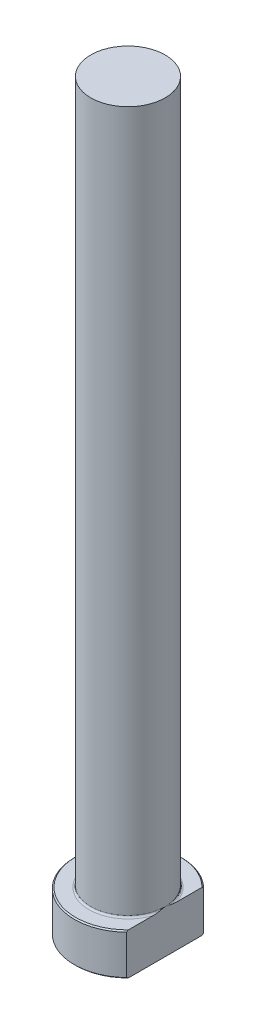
from build123d import *
from build123d.topology import SkipClean

# Parameters (mm, degrees)
CHAMFER1_SIZE = 0.2
FILLET1_R     = 0.3
KEY_DEPTH     = 126.646329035


with BuildPart() as part:
    # Sketch1 → Revolve1 (revolve)
    with BuildSketch(Plane.XY, mode=Mode.PRIVATE) as revolve1_sk:
        Polygon((0, 0), (-9, 0), (-9, 7), (-6.25, 7), (-6.25, 125), (0, 125), align=None)
    revolve(revolve1_sk.sketch.rotate(Axis((0, 259.958771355, 0), (0, -1, 0)), 270), axis=Axis((0, 259.958771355, 0), (0, -1, 0)))

    # Chamfer1
    chamfer1_edges = [part.edges().sort_by_distance(p)[0] for p in [
        (0, 7, -9),
        (0, 0, -9),
    ]]
    chamfer(chamfer1_edges, length=CHAMFER1_SIZE)

    # Fillet1
    fillet1_edges = [part.edges().sort_by_distance(p)[0] for p in [
        (0, 7, -6.25),
    ]]
    fillet(fillet1_edges, radius=FILLET1_R)

    # Sketch2 → KEY (cut, through all)
    with SkipClean():  # the faces are left unmerged after this step: merging them gives an invalid solid
        with BuildSketch(Plane(origin=(0, 0, 0), x_dir=(1, 0, 0), z_dir=(0, 1, 0))):
            with BuildLine():
                Line((6.25, 6.475916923), (6.25, -6.475916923))
                ThreePointArc((6.25, -6.475916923), (9, 0), (6.25, 6.475916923))
            make_face()
        extrude(amount=KEY_DEPTH, mode=Mode.SUBTRACT)


solid = part.part
